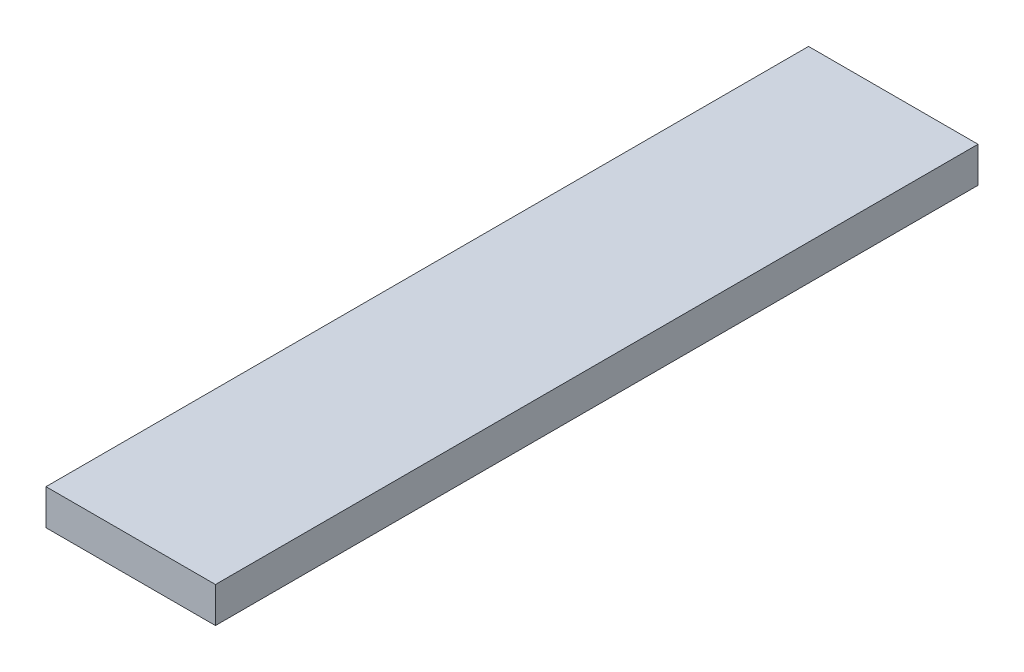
ISO-10303-21;
HEADER;
FILE_DESCRIPTION(('STEP AP214'),'2;1');
FILE_NAME('part.step','',(''),(''),'','','');
FILE_SCHEMA(('AUTOMOTIVE_DESIGN { 1 0 10303 214 1 1 1 1 }'));
ENDSEC;
DATA;
#1=APPLICATION_CONTEXT('core data for automotive mechanical design processes');
#2=APPLICATION_PROTOCOL_DEFINITION('international standard','automotive_design',2000,#1);
#3=PRODUCT_CONTEXT('',#1,'mechanical');
#4=PRODUCT('Part','Part','',(#3));
#5=PRODUCT_RELATED_PRODUCT_CATEGORY('part','',(#4));
#6=PRODUCT_DEFINITION_FORMATION('','',#4);
#7=PRODUCT_DEFINITION_CONTEXT('part definition',#1,'design');
#8=PRODUCT_DEFINITION('design','',#6,#7);
#9=PRODUCT_DEFINITION_SHAPE('','',#8);
#10=(LENGTH_UNIT() NAMED_UNIT(*) SI_UNIT(.MILLI.,.METRE.));
#11=(NAMED_UNIT(*) PLANE_ANGLE_UNIT() SI_UNIT($,.RADIAN.));
#12=(NAMED_UNIT(*) SI_UNIT($,.STERADIAN.) SOLID_ANGLE_UNIT());
#13=UNCERTAINTY_MEASURE_WITH_UNIT(LENGTH_MEASURE(1.E-05),#10,'distance_accuracy_value','');
#14=(GEOMETRIC_REPRESENTATION_CONTEXT(3) GLOBAL_UNCERTAINTY_ASSIGNED_CONTEXT((#13)) GLOBAL_UNIT_ASSIGNED_CONTEXT((#10,
#11,#12)) REPRESENTATION_CONTEXT('',''));
#15=CARTESIAN_POINT('',(0.,0.,0.));
#16=DIRECTION('',(0.,0.,1.));
#17=DIRECTION('',(1.,0.,0.));
#18=AXIS2_PLACEMENT_3D('',#15,#16,#17);
#19=CARTESIAN_POINT('',(0.,0.,450.));
#20=DIRECTION('',(1.,0.,0.));
#21=DIRECTION('',(0.,1.,0.));
#22=AXIS2_PLACEMENT_3D('',#19,#20,#21);
#23=PLANE('',#22);
#24=DIRECTION('',(0.,-1.,0.));
#25=VECTOR('',#24,1.);
#26=CARTESIAN_POINT('',(0.,0.,0.));
#27=LINE('',#26,#25);
#28=CARTESIAN_POINT('',(0.,0.,0.));
#29=VERTEX_POINT('',#28);
#30=CARTESIAN_POINT('',(0.,-21.,0.));
#31=VERTEX_POINT('',#30);
#32=EDGE_CURVE('E83',#29,#31,#27,.T.);
#33=ORIENTED_EDGE('',*,*,#32,.T.);
#34=DIRECTION('',(0.,0.,-1.));
#35=VECTOR('',#34,1.);
#36=CARTESIAN_POINT('',(0.,-21.,450.));
#37=LINE('',#36,#35);
#38=CARTESIAN_POINT('',(0.,-21.,450.));
#39=VERTEX_POINT('',#38);
#40=EDGE_CURVE('E11',#39,#31,#37,.T.);
#41=ORIENTED_EDGE('',*,*,#40,.F.);
#42=DIRECTION('',(0.,-1.,0.));
#43=VECTOR('',#42,1.);
#44=CARTESIAN_POINT('',(0.,0.,450.));
#45=LINE('',#44,#43);
#46=CARTESIAN_POINT('',(0.,0.,450.));
#47=VERTEX_POINT('',#46);
#48=EDGE_CURVE('E101',#47,#39,#45,.T.);
#49=ORIENTED_EDGE('',*,*,#48,.F.);
#50=DIRECTION('',(0.,0.,-1.));
#51=VECTOR('',#50,1.);
#52=CARTESIAN_POINT('',(0.,0.,450.));
#53=LINE('',#52,#51);
#54=EDGE_CURVE('E95',#47,#29,#53,.T.);
#55=ORIENTED_EDGE('',*,*,#54,.T.);
#56=EDGE_LOOP('',(#33,#41,#49,#55));
#57=FACE_BOUND('',#56,.T.);
#58=ADVANCED_FACE('F37',(#57),#23,.F.);
#59=CARTESIAN_POINT('',(0.,-21.,450.));
#60=DIRECTION('',(0.,1.,0.));
#61=DIRECTION('',(0.,0.,1.));
#62=AXIS2_PLACEMENT_3D('',#59,#60,#61);
#63=PLANE('',#62);
#64=DIRECTION('',(1.,0.,0.));
#65=VECTOR('',#64,1.);
#66=CARTESIAN_POINT('',(0.,-21.,0.));
#67=LINE('',#66,#65);
#68=CARTESIAN_POINT('',(100.,-21.,0.));
#69=VERTEX_POINT('',#68);
#70=EDGE_CURVE('E79',#31,#69,#67,.T.);
#71=ORIENTED_EDGE('',*,*,#70,.T.);
#72=DIRECTION('',(0.,0.,-1.));
#73=VECTOR('',#72,1.);
#74=CARTESIAN_POINT('',(100.,-21.,450.));
#75=LINE('',#74,#73);
#76=CARTESIAN_POINT('',(100.,-21.,450.));
#77=VERTEX_POINT('',#76);
#78=EDGE_CURVE('E44',#77,#69,#75,.T.);
#79=ORIENTED_EDGE('',*,*,#78,.F.);
#80=DIRECTION('',(1.,0.,0.));
#81=VECTOR('',#80,1.);
#82=CARTESIAN_POINT('',(0.,-21.,450.));
#83=LINE('',#82,#81);
#84=EDGE_CURVE('E91',#39,#77,#83,.T.);
#85=ORIENTED_EDGE('',*,*,#84,.F.);
#86=ORIENTED_EDGE('',*,*,#40,.T.);
#87=EDGE_LOOP('',(#71,#79,#85,#86));
#88=FACE_BOUND('',#87,.T.);
#89=ADVANCED_FACE('F90',(#88),#63,.F.);
#90=CARTESIAN_POINT('',(100.,0.,450.));
#91=DIRECTION('',(-1.,0.,0.));
#92=DIRECTION('',(0.,0.,1.));
#93=AXIS2_PLACEMENT_3D('',#90,#91,#92);
#94=PLANE('',#93);
#95=DIRECTION('',(0.,1.,0.));
#96=VECTOR('',#95,1.);
#97=CARTESIAN_POINT('',(100.,0.,0.));
#98=LINE('',#97,#96);
#99=CARTESIAN_POINT('',(100.,0.,0.));
#100=VERTEX_POINT('',#99);
#101=EDGE_CURVE('E84',#69,#100,#98,.T.);
#102=ORIENTED_EDGE('',*,*,#101,.T.);
#103=DIRECTION('',(0.,0.,-1.));
#104=VECTOR('',#103,1.);
#105=CARTESIAN_POINT('',(100.,0.,450.));
#106=LINE('',#105,#104);
#107=CARTESIAN_POINT('',(100.,0.,450.));
#108=VERTEX_POINT('',#107);
#109=EDGE_CURVE('E107',#108,#100,#106,.T.);
#110=ORIENTED_EDGE('',*,*,#109,.F.);
#111=DIRECTION('',(0.,1.,0.));
#112=VECTOR('',#111,1.);
#113=CARTESIAN_POINT('',(100.,0.,450.));
#114=LINE('',#113,#112);
#115=EDGE_CURVE('E56',#77,#108,#114,.T.);
#116=ORIENTED_EDGE('',*,*,#115,.F.);
#117=ORIENTED_EDGE('',*,*,#78,.T.);
#118=EDGE_LOOP('',(#102,#110,#116,#117));
#119=FACE_BOUND('',#118,.T.);
#120=ADVANCED_FACE('F110',(#119),#94,.F.);
#121=CARTESIAN_POINT('',(0.,0.,450.));
#122=DIRECTION('',(0.,-1.,0.));
#123=DIRECTION('',(0.,0.,-1.));
#124=AXIS2_PLACEMENT_3D('',#121,#122,#123);
#125=PLANE('',#124);
#126=DIRECTION('',(-1.,0.,0.));
#127=VECTOR('',#126,1.);
#128=CARTESIAN_POINT('',(0.,0.,0.));
#129=LINE('',#128,#127);
#130=EDGE_CURVE('E99',#100,#29,#129,.T.);
#131=ORIENTED_EDGE('',*,*,#130,.T.);
#132=ORIENTED_EDGE('',*,*,#54,.F.);
#133=DIRECTION('',(-1.,0.,0.));
#134=VECTOR('',#133,1.);
#135=CARTESIAN_POINT('',(0.,0.,450.));
#136=LINE('',#135,#134);
#137=EDGE_CURVE('E51',#108,#47,#136,.T.);
#138=ORIENTED_EDGE('',*,*,#137,.F.);
#139=ORIENTED_EDGE('',*,*,#109,.T.);
#140=EDGE_LOOP('',(#131,#132,#138,#139));
#141=FACE_BOUND('',#140,.T.);
#142=ADVANCED_FACE('F112',(#141),#125,.F.);
#143=CARTESIAN_POINT('',(0.,-21.,450.));
#144=DIRECTION('',(0.,0.,1.));
#145=DIRECTION('',(1.,0.,0.));
#146=AXIS2_PLACEMENT_3D('',#143,#144,#145);
#147=PLANE('',#146);
#148=ORIENTED_EDGE('',*,*,#48,.T.);
#149=ORIENTED_EDGE('',*,*,#84,.T.);
#150=ORIENTED_EDGE('',*,*,#115,.T.);
#151=ORIENTED_EDGE('',*,*,#137,.T.);
#152=EDGE_LOOP('',(#148,#149,#150,#151));
#153=FACE_BOUND('',#152,.T.);
#154=ADVANCED_FACE('F113',(#153),#147,.T.);
#155=CARTESIAN_POINT('',(0.,-21.,0.));
#156=DIRECTION('',(0.,0.,1.));
#157=DIRECTION('',(1.,0.,0.));
#158=AXIS2_PLACEMENT_3D('',#155,#156,#157);
#159=PLANE('',#158);
#160=ORIENTED_EDGE('',*,*,#32,.F.);
#161=ORIENTED_EDGE('',*,*,#130,.F.);
#162=ORIENTED_EDGE('',*,*,#101,.F.);
#163=ORIENTED_EDGE('',*,*,#70,.F.);
#164=EDGE_LOOP('',(#160,#161,#162,#163));
#165=FACE_BOUND('',#164,.T.);
#166=ADVANCED_FACE('F80',(#165),#159,.F.);
#167=CLOSED_SHELL('',(#58,#89,#120,#142,#154,#166));
#168=MANIFOLD_SOLID_BREP('B2',#167);
#169=ADVANCED_BREP_SHAPE_REPRESENTATION('',(#18,#168),#14);
#170=SHAPE_DEFINITION_REPRESENTATION(#9,#169);
ENDSEC;
END-ISO-10303-21;
